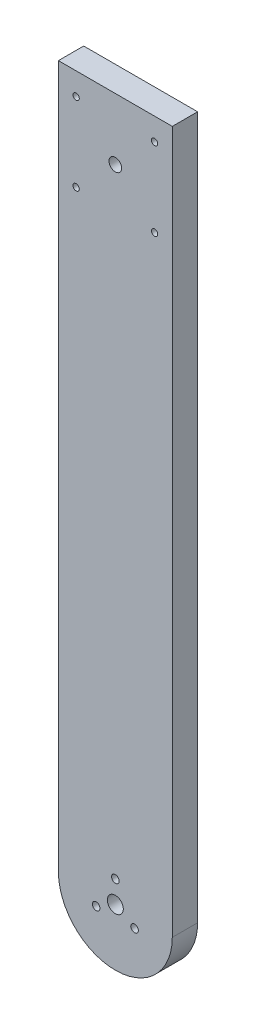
from build123d import *

# Parameters (mm, degrees)
SKETCH1_R           = 1.25
SKETCH1_R_2         = 2.5
SKETCH1_R_3         = 1.5
SKETCH1_R_4         = 3.15
BOSS_EXTRUDE1_DEPTH = 10


with BuildPart() as part:
    # Sketch1 → Boss-Extrude1 (new body)
    with BuildSketch(Plane.XY):
        with BuildLine():
            Line((-22.5, 130), (22.5, 130))
            Line((22.5, 130), (22.5, -147.5))
            ThreePointArc((22.5, -147.5), (0, -170), (-22.5, -147.5))
            Line((-22.5, -147.5), (-22.5, 130))
        make_face()
        with Locations((-15.5, 121.163920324)):
            Circle(SKETCH1_R, mode=Mode.SUBTRACT)
        with Locations(Location((15.5, 121.163920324, 0), (0, 0, 180))):
            Circle(SKETCH1_R, mode=Mode.SUBTRACT)
        with Locations((15.5, 90.163920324)):
            Circle(SKETCH1_R, mode=Mode.SUBTRACT)
        with Locations(Location((-15.5, 90.163920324, 0), (0, 0, 180))):
            Circle(SKETCH1_R, mode=Mode.SUBTRACT)
        with Locations((0, 105.663920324)):
            Circle(SKETCH1_R_2, mode=Mode.SUBTRACT)
        with Locations((0, -138.75)):
            Circle(SKETCH1_R_3, mode=Mode.SUBTRACT)
        with Locations((7.577722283, -151.875)):
            Circle(SKETCH1_R_3, mode=Mode.SUBTRACT)
        with Locations((-7.577722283, -151.875)):
            Circle(SKETCH1_R_3, mode=Mode.SUBTRACT)
        with Locations((0, -147.5)):
            Circle(SKETCH1_R_4, mode=Mode.SUBTRACT)
    extrude(amount=BOSS_EXTRUDE1_DEPTH)


solid = part.part
